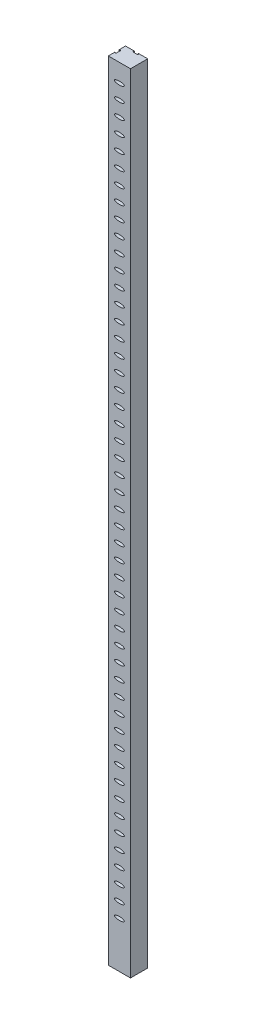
from build123d import *

# Parameters (mm, degrees)
EXTRUSION1_DEPTH           = 1600
ESQUISSE3_RX               = 10
ESQUISSE3_RY               = 3.5
EXTRUSION3_DEPTH           = 10
R_P_TITION_LIN_AIRE2_COUNT = 50
R_P_TITION_LIN_AIRE2_PITCH = 30


with BuildPart() as part:
    # Esquisse1 → Extrusion1 (new body)
    with BuildSketch(Plane(origin=(0, 0, 0), x_dir=(1, 0, 0), z_dir=(0, 1, 0))):
        Polygon((-22.5, 4), (-21.5, 4), (-21.5, 5), (-20.5, 5), (-19.5, 4), (-19.5, -4), (-20.5, -5), (-21.5, -5), (-21.5, -4), (-22.5, -4), (-22.5, -17.5), (22.5, -17.5), (22.5, 17.5), (4, 17.5), (4, 16.5), (5, 16.5), (5, 15.5), (4, 14.5), (-4, 14.5), (-5, 15.5), (-5, 16.5), (-4, 16.5), (-4, 17.5), (-22.5, 17.5), align=None)
    extrude(amount=EXTRUSION1_DEPTH)

    # Esquisse3 → Extrusion3 (cut)
    with BuildSketch(Plane.XY.offset(17.5)):
        with Locations(Location((0, 1563.5), (0, 0, 0))):
            Ellipse(ESQUISSE3_RX, ESQUISSE3_RY)
    extrusion3 = extrude(amount=-EXTRUSION3_DEPTH, mode=Mode.SUBTRACT)

    # R_p_tition lin_aire2: Extrusion3 ×50
    with Locations(*[(0, -i * R_P_TITION_LIN_AIRE2_PITCH, 0) for i in range(1, R_P_TITION_LIN_AIRE2_COUNT)]):
        add(extrusion3, mode=Mode.SUBTRACT)


solid = part.part
